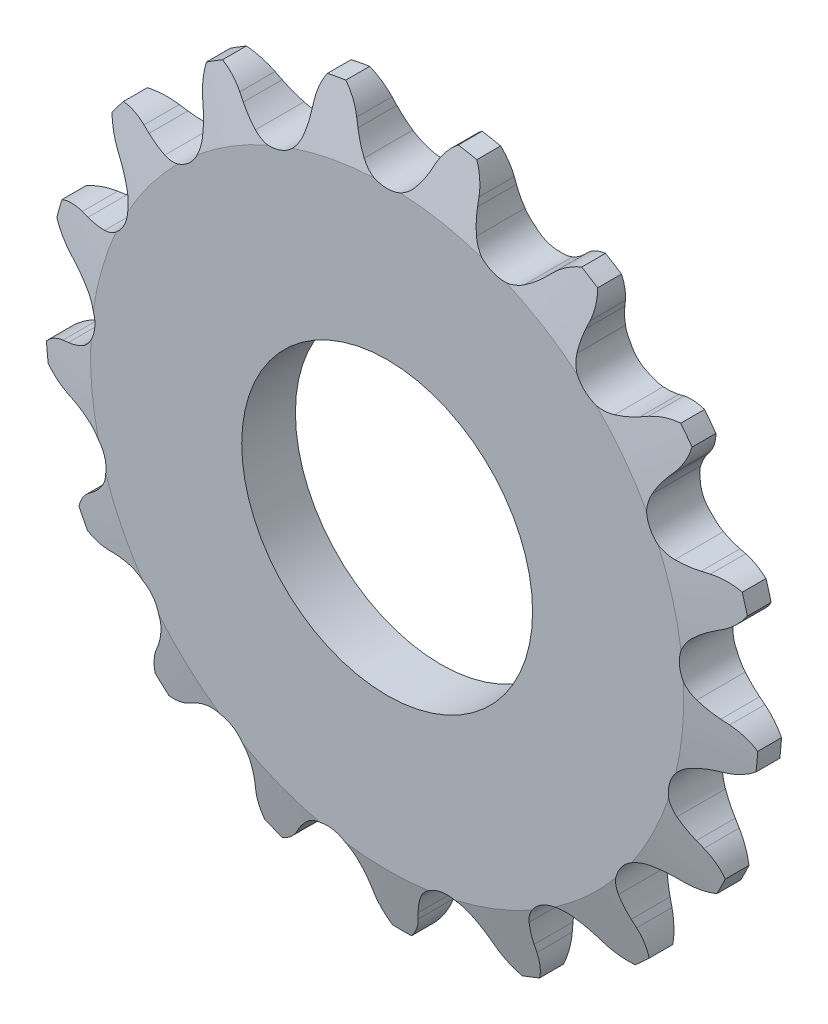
from build123d import *

# Parameters (mm, degrees)
CUT_EXTRUDE1_DEPTH      = 41.127972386
CIRPATTERN1_COUNT       = 17
CUT_EXTRUDE2_DEPTH      = 41.08389358
CUT_EXTRUDE2_DEPTH_BACK = 41.08389358
SKETCH3_OUTSIDE_W       = 74.528
SKETCH3_OUTSIDE_H       = 74.297
SKETCH3_OUTSIDE_R       = 28.321
SKETCH3_OUTSIDE_R_2     = 6.35
SKETCH4_R               = 11.557
CUT_EXTRUDE3_DEPTH      = 41.235359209


with BuildPart() as part:
    # Sketch1 → Revolve1 (revolve)
    with BuildSketch(Plane(origin=(0, 0, 0), x_dir=(0, 0, -1), z_dir=(1, 0, 0)), mode=Mode.PRIVATE) as revolve1_sk:
        Polygon((2.1336, 0), (-2.1336, 0), (-2.1336, 23.572124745), (-0.942975, 28.334624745), (0.942975, 28.334624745), (2.1336, 23.572124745), align=None)
    revolve(revolve1_sk.sketch.rotate(Axis((0, 0, -2.1336), (0, 0, 1)), 90), axis=Axis((0, 0, -2.1336), (0, 0, 1)))

    # Sketch0 → Cut-Extrude1 (cut, symmetric)
    with BuildSketch(Plane.XY):
        with BuildLine():
            Line((7.929944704, -25.281073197), (7.592772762, -24.788862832))
            ThreePointArc((7.592772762, -24.788862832), (7.066304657, -24.117149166), (6.458199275, -23.51833721))
            ThreePointArc((6.458199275, -23.51833721), (4.286441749, -22.930438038), (2.473711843, -24.263166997))
            ThreePointArc((2.473711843, -24.263166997), (2.122986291, -25.041215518), (1.874720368, -25.857752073))
            Line((1.874720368, -25.857752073), (1.738123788, -26.438525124))
            ThreePointArc((1.738123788, -26.438525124), (0.103733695, -28.88514519), (-2.735110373, -29.65854359))
            ThreePointArc((-2.735110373, -29.65854359), (5.47286776, -29.277256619), (13.26431617, -26.667732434))
            ThreePointArc((13.26431617, -26.667732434), (10.337789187, -26.972068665), (7.929944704, -25.281073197))
        make_face()
    cut_extrude1 = extrude(amount=CUT_EXTRUDE1_DEPTH, both=True, mode=Mode.SUBTRACT)

    # CirPattern1: Cut-Extrude1 ×17 about axis
    cirpattern1_axis = Axis((0, 0, 0), (0, 0, 1))
    for i in range(1, CIRPATTERN1_COUNT):
        add(cut_extrude1.rotate(cirpattern1_axis, i * 360 / CIRPATTERN1_COUNT), mode=Mode.SUBTRACT)

    # Sketch3 outside → Cut-Extrude2 (cut, two sides: drawn at the far end of the back side and taken through both)
    # profile 1 of 2: a face of its own
    with BuildSketch(Plane.XY.offset(-CUT_EXTRUDE2_DEPTH_BACK)):
        with Locations((0, -0.1785)):
            Rectangle(SKETCH3_OUTSIDE_W, SKETCH3_OUTSIDE_H)
        Circle(SKETCH3_OUTSIDE_R, mode=Mode.SUBTRACT)
    # profile 2 of 2: a face of its own
    with BuildSketch(Plane.XY.offset(-CUT_EXTRUDE2_DEPTH_BACK)):
        Circle(SKETCH3_OUTSIDE_R_2)
    extrude(amount=CUT_EXTRUDE2_DEPTH + CUT_EXTRUDE2_DEPTH_BACK, mode=Mode.SUBTRACT)

    # Sketch4 → Cut-Extrude3 (cut, through all)
    with BuildSketch(Plane(origin=(0, 0, -2.1336), x_dir=(-1, 0, 0), z_dir=(0, 0, -1))):
        Circle(SKETCH4_R)
    extrude(amount=-CUT_EXTRUDE3_DEPTH, mode=Mode.SUBTRACT)


solid = part.part
